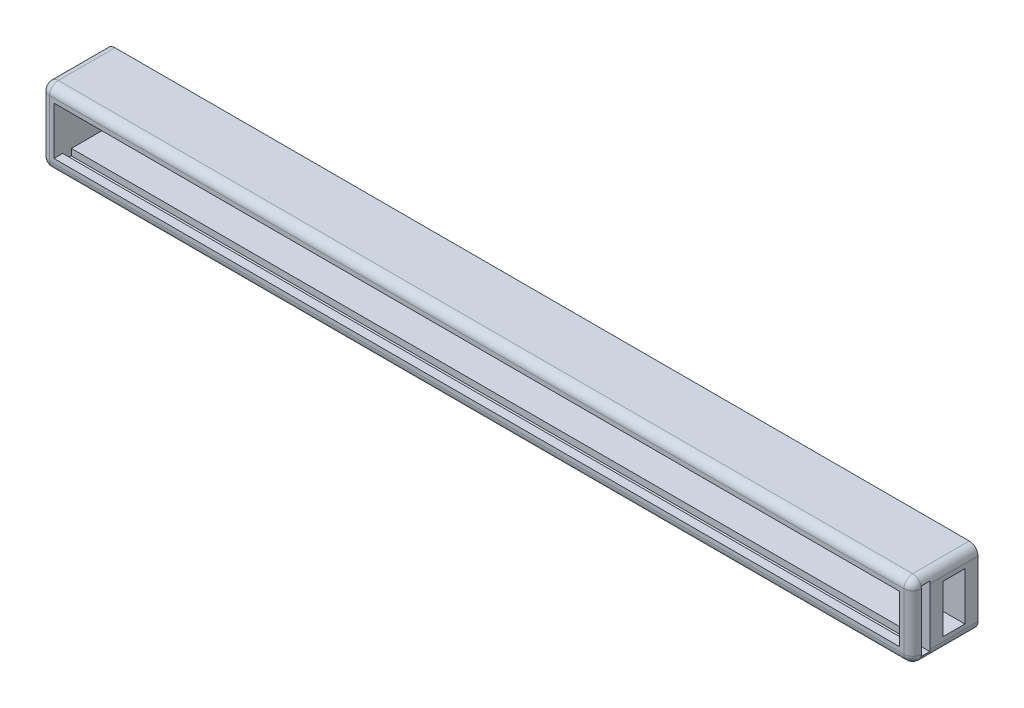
ISO-10303-21;
HEADER;
FILE_DESCRIPTION(('STEP AP214'),'2;1');
FILE_NAME('part.step','',(''),(''),'','','');
FILE_SCHEMA(('AUTOMOTIVE_DESIGN { 1 0 10303 214 1 1 1 1 }'));
ENDSEC;
DATA;
#1=APPLICATION_CONTEXT('core data for automotive mechanical design processes');
#2=APPLICATION_PROTOCOL_DEFINITION('international standard','automotive_design',2000,#1);
#3=PRODUCT_CONTEXT('',#1,'mechanical');
#4=PRODUCT('Part','Part','',(#3));
#5=PRODUCT_RELATED_PRODUCT_CATEGORY('part','',(#4));
#6=PRODUCT_DEFINITION_FORMATION('','',#4);
#7=PRODUCT_DEFINITION_CONTEXT('part definition',#1,'design');
#8=PRODUCT_DEFINITION('design','',#6,#7);
#9=PRODUCT_DEFINITION_SHAPE('','',#8);
#10=(LENGTH_UNIT() NAMED_UNIT(*) SI_UNIT(.MILLI.,.METRE.));
#11=(NAMED_UNIT(*) PLANE_ANGLE_UNIT() SI_UNIT($,.RADIAN.));
#12=(NAMED_UNIT(*) SI_UNIT($,.STERADIAN.) SOLID_ANGLE_UNIT());
#13=UNCERTAINTY_MEASURE_WITH_UNIT(LENGTH_MEASURE(1.E-05),#10,'distance_accuracy_value','');
#14=(GEOMETRIC_REPRESENTATION_CONTEXT(3) GLOBAL_UNCERTAINTY_ASSIGNED_CONTEXT((#13)) GLOBAL_UNIT_ASSIGNED_CONTEXT((#10,
#11,#12)) REPRESENTATION_CONTEXT('',''));
#15=CARTESIAN_POINT('',(0.,0.,0.));
#16=DIRECTION('',(0.,0.,1.));
#17=DIRECTION('',(1.,0.,0.));
#18=AXIS2_PLACEMENT_3D('',#15,#16,#17);
#19=CARTESIAN_POINT('',(100.,-8.49999999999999,15.));
#20=DIRECTION('',(-1.,0.,0.));
#21=DIRECTION('',(0.,0.,1.));
#22=AXIS2_PLACEMENT_3D('',#19,#20,#21);
#23=PLANE('',#22);
#24=DIRECTION('',(0.,0.,1.));
#25=VECTOR('',#24,1.);
#26=CARTESIAN_POINT('',(100.,5.50000000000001,3.));
#27=LINE('',#26,#25);
#28=CARTESIAN_POINT('',(100.,5.50000000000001,3.));
#29=VERTEX_POINT('',#28);
#30=CARTESIAN_POINT('',(100.,5.50000000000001,8.));
#31=VERTEX_POINT('',#30);
#32=EDGE_CURVE('E273',#29,#31,#27,.T.);
#33=ORIENTED_EDGE('',*,*,#32,.F.);
#34=DIRECTION('',(0.,1.,0.));
#35=VECTOR('',#34,1.);
#36=CARTESIAN_POINT('',(100.,-5.49999999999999,3.));
#37=LINE('',#36,#35);
#38=CARTESIAN_POINT('',(100.,-5.49999999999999,3.));
#39=VERTEX_POINT('',#38);
#40=EDGE_CURVE('E270',#39,#29,#37,.T.);
#41=ORIENTED_EDGE('',*,*,#40,.F.);
#42=DIRECTION('',(0.,0.,-1.));
#43=VECTOR('',#42,1.);
#44=CARTESIAN_POINT('',(100.,-5.49999999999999,3.));
#45=LINE('',#44,#43);
#46=CARTESIAN_POINT('',(100.,-5.49999999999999,8.));
#47=VERTEX_POINT('',#46);
#48=EDGE_CURVE('E280',#47,#39,#45,.T.);
#49=ORIENTED_EDGE('',*,*,#48,.F.);
#50=DIRECTION('',(0.,-1.,0.));
#51=VECTOR('',#50,1.);
#52=CARTESIAN_POINT('',(100.,-5.49999999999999,8.));
#53=LINE('',#52,#51);
#54=EDGE_CURVE('E277',#31,#47,#53,.T.);
#55=ORIENTED_EDGE('',*,*,#54,.F.);
#56=EDGE_LOOP('',(#33,#41,#49,#55));
#57=FACE_BOUND('',#56,.T.);
#58=DIRECTION('',(0.,1.,0.));
#59=VECTOR('',#58,1.);
#60=CARTESIAN_POINT('',(100.,6.99999999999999,11.));
#61=LINE('',#60,#59);
#62=CARTESIAN_POINT('',(100.,-6.49999999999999,11.));
#63=VERTEX_POINT('',#62);
#64=CARTESIAN_POINT('',(100.,6.50000000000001,11.));
#65=VERTEX_POINT('',#64);
#66=EDGE_CURVE('E236',#63,#65,#61,.T.);
#67=ORIENTED_EDGE('',*,*,#66,.F.);
#68=DIRECTION('',(0.,0.,-1.));
#69=VECTOR('',#68,1.);
#70=CARTESIAN_POINT('',(100.,-6.49999999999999,15.));
#71=LINE('',#70,#69);
#72=CARTESIAN_POINT('',(100.,-6.49999999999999,0.));
#73=VERTEX_POINT('',#72);
#74=EDGE_CURVE('E53',#63,#73,#71,.T.);
#75=ORIENTED_EDGE('',*,*,#74,.T.);
#76=DIRECTION('',(0.,1.,0.));
#77=VECTOR('',#76,1.);
#78=CARTESIAN_POINT('',(100.,-8.49999999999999,0.));
#79=LINE('',#78,#77);
#80=CARTESIAN_POINT('',(100.,6.50000000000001,0.));
#81=VERTEX_POINT('',#80);
#82=EDGE_CURVE('E319',#73,#81,#79,.T.);
#83=ORIENTED_EDGE('',*,*,#82,.T.);
#84=DIRECTION('',(0.,0.,-1.));
#85=VECTOR('',#84,1.);
#86=CARTESIAN_POINT('',(100.,6.50000000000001,15.));
#87=LINE('',#86,#85);
#88=EDGE_CURVE('E400',#81,#65,#87,.F.);
#89=ORIENTED_EDGE('',*,*,#88,.T.);
#90=EDGE_LOOP('',(#67,#75,#83,#89));
#91=FACE_BOUND('',#90,.T.);
#92=ADVANCED_FACE('F45',(#57,#91),#23,.F.);
#93=CARTESIAN_POINT('',(-97.,-5.49999999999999,24.));
#94=DIRECTION('',(0.,1.,0.));
#95=DIRECTION('',(0.,0.,1.));
#96=AXIS2_PLACEMENT_3D('',#93,#94,#95);
#97=PLANE('',#96);
#98=DIRECTION('',(0.,0.,-1.));
#99=VECTOR('',#98,1.);
#100=CARTESIAN_POINT('',(-97.,-5.49999999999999,24.));
#101=LINE('',#100,#99);
#102=CARTESIAN_POINT('',(-97.,-5.49999999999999,11.));
#103=VERTEX_POINT('',#102);
#104=CARTESIAN_POINT('',(-97.,-5.49999999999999,3.));
#105=VERTEX_POINT('',#104);
#106=EDGE_CURVE('E310',#103,#105,#101,.T.);
#107=ORIENTED_EDGE('',*,*,#106,.F.);
#108=DIRECTION('',(1.,0.,0.));
#109=VECTOR('',#108,1.);
#110=CARTESIAN_POINT('',(-97.,-5.49999999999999,11.));
#111=LINE('',#110,#109);
#112=CARTESIAN_POINT('',(97.,-5.49999999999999,11.));
#113=VERTEX_POINT('',#112);
#114=EDGE_CURVE('E218',#103,#113,#111,.T.);
#115=ORIENTED_EDGE('',*,*,#114,.T.);
#116=DIRECTION('',(0.,0.,-1.));
#117=VECTOR('',#116,1.);
#118=CARTESIAN_POINT('',(97.,-5.49999999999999,24.));
#119=LINE('',#118,#117);
#120=CARTESIAN_POINT('',(97.,-5.49999999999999,8.));
#121=VERTEX_POINT('',#120);
#122=EDGE_CURVE('E306',#113,#121,#119,.T.);
#123=ORIENTED_EDGE('',*,*,#122,.T.);
#124=DIRECTION('',(1.,0.,0.));
#125=VECTOR('',#124,1.);
#126=CARTESIAN_POINT('',(88.,-5.49999999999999,8.));
#127=LINE('',#126,#125);
#128=EDGE_CURVE('E284',#121,#47,#127,.T.);
#129=ORIENTED_EDGE('',*,*,#128,.T.);
#130=ORIENTED_EDGE('',*,*,#48,.T.);
#131=DIRECTION('',(1.,0.,0.));
#132=VECTOR('',#131,1.);
#133=CARTESIAN_POINT('',(-97.,-5.49999999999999,3.));
#134=LINE('',#133,#132);
#135=EDGE_CURVE('E293',#105,#39,#134,.T.);
#136=ORIENTED_EDGE('',*,*,#135,.F.);
#137=EDGE_LOOP('',(#107,#115,#123,#129,#130,#136));
#138=FACE_BOUND('',#137,.T.);
#139=ADVANCED_FACE('F492',(#138),#97,.T.);
#140=CARTESIAN_POINT('',(97.,5.49999999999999,24.));
#141=DIRECTION('',(-1.,0.,0.));
#142=DIRECTION('',(0.,0.,1.));
#143=AXIS2_PLACEMENT_3D('',#140,#141,#142);
#144=PLANE('',#143);
#145=ORIENTED_EDGE('',*,*,#122,.F.);
#146=DIRECTION('',(0.,1.,0.));
#147=VECTOR('',#146,1.);
#148=CARTESIAN_POINT('',(97.,5.49999999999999,11.));
#149=LINE('',#148,#147);
#150=CARTESIAN_POINT('',(97.,5.49999999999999,11.));
#151=VERTEX_POINT('',#150);
#152=EDGE_CURVE('E264',#113,#151,#149,.T.);
#153=ORIENTED_EDGE('',*,*,#152,.T.);
#154=DIRECTION('',(0.,0.,-1.));
#155=VECTOR('',#154,1.);
#156=CARTESIAN_POINT('',(97.,5.49999999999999,24.));
#157=LINE('',#156,#155);
#158=CARTESIAN_POINT('',(97.,5.49999999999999,8.));
#159=VERTEX_POINT('',#158);
#160=EDGE_CURVE('E302',#151,#159,#157,.T.);
#161=ORIENTED_EDGE('',*,*,#160,.T.);
#162=DIRECTION('',(0.,1.,0.));
#163=VECTOR('',#162,1.);
#164=CARTESIAN_POINT('',(97.,5.49999999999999,8.));
#165=LINE('',#164,#163);
#166=EDGE_CURVE('E286',#121,#159,#165,.T.);
#167=ORIENTED_EDGE('',*,*,#166,.F.);
#168=EDGE_LOOP('',(#145,#153,#161,#167));
#169=FACE_BOUND('',#168,.T.);
#170=ADVANCED_FACE('F490',(#169),#144,.T.);
#171=CARTESIAN_POINT('',(-97.,5.49999999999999,24.));
#172=DIRECTION('',(0.,-1.,0.));
#173=DIRECTION('',(0.,0.,-1.));
#174=AXIS2_PLACEMENT_3D('',#171,#172,#173);
#175=PLANE('',#174);
#176=ORIENTED_EDGE('',*,*,#160,.F.);
#177=DIRECTION('',(-1.,0.,0.));
#178=VECTOR('',#177,1.);
#179=CARTESIAN_POINT('',(-97.,5.49999999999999,11.));
#180=LINE('',#179,#178);
#181=CARTESIAN_POINT('',(-97.,5.49999999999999,11.));
#182=VERTEX_POINT('',#181);
#183=EDGE_CURVE('E262',#151,#182,#180,.T.);
#184=ORIENTED_EDGE('',*,*,#183,.T.);
#185=DIRECTION('',(0.,0.,-1.));
#186=VECTOR('',#185,1.);
#187=CARTESIAN_POINT('',(-97.,5.49999999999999,24.));
#188=LINE('',#187,#186);
#189=CARTESIAN_POINT('',(-97.,5.49999999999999,3.));
#190=VERTEX_POINT('',#189);
#191=EDGE_CURVE('E298',#182,#190,#188,.T.);
#192=ORIENTED_EDGE('',*,*,#191,.T.);
#193=DIRECTION('',(-1.,0.,0.));
#194=VECTOR('',#193,1.);
#195=CARTESIAN_POINT('',(-97.,5.49999999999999,3.));
#196=LINE('',#195,#194);
#197=EDGE_CURVE('E295',#29,#190,#196,.T.);
#198=ORIENTED_EDGE('',*,*,#197,.F.);
#199=ORIENTED_EDGE('',*,*,#32,.T.);
#200=DIRECTION('',(1.,0.,0.));
#201=VECTOR('',#200,1.);
#202=CARTESIAN_POINT('',(88.,5.50000000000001,8.));
#203=LINE('',#202,#201);
#204=EDGE_CURVE('E283',#159,#31,#203,.T.);
#205=ORIENTED_EDGE('',*,*,#204,.F.);
#206=EDGE_LOOP('',(#176,#184,#192,#198,#199,#205));
#207=FACE_BOUND('',#206,.T.);
#208=ADVANCED_FACE('F474',(#207),#175,.T.);
#209=CARTESIAN_POINT('',(98.,-6.49999999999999,15.));
#210=DIRECTION('',(0.,0.,-1.));
#211=DIRECTION('',(-1.,0.,0.));
#212=AXIS2_PLACEMENT_3D('',#209,#210,#211);
#213=CYLINDRICAL_SURFACE('',#212,2.);
#214=CARTESIAN_POINT('',(98.,-6.49999999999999,11.));
#215=DIRECTION('',(0.,0.,1.));
#216=DIRECTION('',(1.,0.,0.));
#217=AXIS2_PLACEMENT_3D('',#214,#215,#216);
#218=CIRCLE('',#217,2.);
#219=CARTESIAN_POINT('',(99.9364916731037,-6.99999999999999,11.));
#220=VERTEX_POINT('',#219);
#221=EDGE_CURVE('E260',#63,#220,#218,.F.);
#222=ORIENTED_EDGE('',*,*,#221,.T.);
#223=DIRECTION('',(0.,0.,-1.));
#224=VECTOR('',#223,1.);
#225=CARTESIAN_POINT('',(99.9364916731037,-6.99999999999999,15.));
#226=LINE('',#225,#224);
#227=CARTESIAN_POINT('',(99.9364916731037,-6.99999999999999,13.));
#228=VERTEX_POINT('',#227);
#229=EDGE_CURVE('E235',#220,#228,#226,.F.);
#230=ORIENTED_EDGE('',*,*,#229,.T.);
#231=CARTESIAN_POINT('',(98.,-6.49999999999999,13.));
#232=DIRECTION('',(0.,0.,1.));
#233=DIRECTION('',(1.,0.,0.));
#234=AXIS2_PLACEMENT_3D('',#231,#232,#233);
#235=CIRCLE('',#234,2.);
#236=CARTESIAN_POINT('',(98.,-8.49999999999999,13.));
#237=VERTEX_POINT('',#236);
#238=EDGE_CURVE('E409',#237,#228,#235,.T.);
#239=ORIENTED_EDGE('',*,*,#238,.F.);
#240=DIRECTION('',(0.,0.,-1.));
#241=VECTOR('',#240,1.);
#242=CARTESIAN_POINT('',(98.,-8.49999999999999,15.));
#243=LINE('',#242,#241);
#244=CARTESIAN_POINT('',(98.,-8.49999999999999,0.));
#245=VERTEX_POINT('',#244);
#246=EDGE_CURVE('E380',#245,#237,#243,.F.);
#247=ORIENTED_EDGE('',*,*,#246,.F.);
#248=CARTESIAN_POINT('',(98.,-6.49999999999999,0.));
#249=DIRECTION('',(0.,0.,1.));
#250=DIRECTION('',(1.,0.,0.));
#251=AXIS2_PLACEMENT_3D('',#248,#249,#250);
#252=CIRCLE('',#251,2.);
#253=EDGE_CURVE('E386',#73,#245,#252,.F.);
#254=ORIENTED_EDGE('',*,*,#253,.F.);
#255=ORIENTED_EDGE('',*,*,#74,.F.);
#256=EDGE_LOOP('',(#222,#230,#239,#247,#254,#255));
#257=FACE_BOUND('',#256,.T.);
#258=ADVANCED_FACE('F459',(#257),#213,.T.);
#259=CARTESIAN_POINT('',(98.,6.50000000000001,15.));
#260=DIRECTION('',(0.,0.,-1.));
#261=DIRECTION('',(-1.,0.,0.));
#262=AXIS2_PLACEMENT_3D('',#259,#260,#261);
#263=CYLINDRICAL_SURFACE('',#262,2.);
#264=CARTESIAN_POINT('',(98.,6.50000000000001,13.));
#265=DIRECTION('',(0.,0.,1.));
#266=DIRECTION('',(1.,0.,0.));
#267=AXIS2_PLACEMENT_3D('',#264,#265,#266);
#268=CIRCLE('',#267,2.);
#269=CARTESIAN_POINT('',(99.9364916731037,6.99999999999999,13.));
#270=VERTEX_POINT('',#269);
#271=CARTESIAN_POINT('',(98.,8.50000000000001,13.));
#272=VERTEX_POINT('',#271);
#273=EDGE_CURVE('E269',#270,#272,#268,.T.);
#274=ORIENTED_EDGE('',*,*,#273,.F.);
#275=DIRECTION('',(0.,0.,-1.));
#276=VECTOR('',#275,1.);
#277=CARTESIAN_POINT('',(99.9364916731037,6.99999999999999,15.));
#278=LINE('',#277,#276);
#279=CARTESIAN_POINT('',(99.9364916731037,6.99999999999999,11.));
#280=VERTEX_POINT('',#279);
#281=EDGE_CURVE('E257',#270,#280,#278,.T.);
#282=ORIENTED_EDGE('',*,*,#281,.T.);
#283=CARTESIAN_POINT('',(98.,6.50000000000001,11.));
#284=DIRECTION('',(0.,0.,1.));
#285=DIRECTION('',(1.,0.,0.));
#286=AXIS2_PLACEMENT_3D('',#283,#284,#285);
#287=CIRCLE('',#286,2.);
#288=EDGE_CURVE('E11',#280,#65,#287,.F.);
#289=ORIENTED_EDGE('',*,*,#288,.T.);
#290=ORIENTED_EDGE('',*,*,#88,.F.);
#291=CARTESIAN_POINT('',(98.,6.50000000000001,0.));
#292=DIRECTION('',(0.,0.,1.));
#293=DIRECTION('',(1.,0.,0.));
#294=AXIS2_PLACEMENT_3D('',#291,#292,#293);
#295=CIRCLE('',#294,2.);
#296=CARTESIAN_POINT('',(98.,8.50000000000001,0.));
#297=VERTEX_POINT('',#296);
#298=EDGE_CURVE('E384',#297,#81,#295,.F.);
#299=ORIENTED_EDGE('',*,*,#298,.F.);
#300=DIRECTION('',(0.,0.,-1.));
#301=VECTOR('',#300,1.);
#302=CARTESIAN_POINT('',(98.,8.50000000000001,15.));
#303=LINE('',#302,#301);
#304=EDGE_CURVE('E396',#272,#297,#303,.T.);
#305=ORIENTED_EDGE('',*,*,#304,.F.);
#306=EDGE_LOOP('',(#274,#282,#289,#290,#299,#305));
#307=FACE_BOUND('',#306,.T.);
#308=ADVANCED_FACE('F47',(#307),#263,.T.);
#309=CARTESIAN_POINT('',(0.,0.,15.));
#310=DIRECTION('',(0.,0.,1.));
#311=DIRECTION('',(1.,0.,0.));
#312=AXIS2_PLACEMENT_3D('',#309,#310,#311);
#313=PLANE('',#312);
#314=DIRECTION('',(0.,1.,0.));
#315=VECTOR('',#314,1.);
#316=CARTESIAN_POINT('',(98.,8.50000000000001,15.));
#317=LINE('',#316,#315);
#318=CARTESIAN_POINT('',(98.,-6.49999999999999,15.));
#319=VERTEX_POINT('',#318);
#320=CARTESIAN_POINT('',(98.,6.50000000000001,15.));
#321=VERTEX_POINT('',#320);
#322=EDGE_CURVE('E331',#319,#321,#317,.T.);
#323=ORIENTED_EDGE('',*,*,#322,.T.);
#324=DIRECTION('',(-1.,0.,0.));
#325=VECTOR('',#324,1.);
#326=CARTESIAN_POINT('',(-100.,6.49999999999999,15.));
#327=LINE('',#326,#325);
#328=CARTESIAN_POINT('',(-98.,6.49999999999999,15.));
#329=VERTEX_POINT('',#328);
#330=EDGE_CURVE('E334',#321,#329,#327,.T.);
#331=ORIENTED_EDGE('',*,*,#330,.T.);
#332=DIRECTION('',(0.,-1.,0.));
#333=VECTOR('',#332,1.);
#334=CARTESIAN_POINT('',(-98.,-8.50000000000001,15.));
#335=LINE('',#334,#333);
#336=CARTESIAN_POINT('',(-98.,-6.50000000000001,15.));
#337=VERTEX_POINT('',#336);
#338=EDGE_CURVE('E325',#329,#337,#335,.T.);
#339=ORIENTED_EDGE('',*,*,#338,.T.);
#340=DIRECTION('',(1.,0.,0.));
#341=VECTOR('',#340,1.);
#342=CARTESIAN_POINT('',(100.,-6.49999999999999,15.));
#343=LINE('',#342,#341);
#344=EDGE_CURVE('E328',#337,#319,#343,.T.);
#345=ORIENTED_EDGE('',*,*,#344,.T.);
#346=EDGE_LOOP('',(#323,#331,#339,#345));
#347=FACE_BOUND('',#346,.T.);
#348=DIRECTION('',(-1.,0.,0.));
#349=VECTOR('',#348,1.);
#350=CARTESIAN_POINT('',(0.,-5.49999999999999,15.));
#351=LINE('',#350,#349);
#352=CARTESIAN_POINT('',(97.,-5.49999999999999,15.));
#353=VERTEX_POINT('',#352);
#354=CARTESIAN_POINT('',(-97.,-5.49999999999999,15.));
#355=VERTEX_POINT('',#354);
#356=EDGE_CURVE('E354',#353,#355,#351,.T.);
#357=ORIENTED_EDGE('',*,*,#356,.T.);
#358=DIRECTION('',(0.,1.,0.));
#359=VECTOR('',#358,1.);
#360=CARTESIAN_POINT('',(-97.,0.,15.));
#361=LINE('',#360,#359);
#362=CARTESIAN_POINT('',(-97.,5.49999999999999,15.));
#363=VERTEX_POINT('',#362);
#364=EDGE_CURVE('E357',#355,#363,#361,.T.);
#365=ORIENTED_EDGE('',*,*,#364,.T.);
#366=DIRECTION('',(1.,0.,0.));
#367=VECTOR('',#366,1.);
#368=CARTESIAN_POINT('',(0.,5.49999999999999,15.));
#369=LINE('',#368,#367);
#370=CARTESIAN_POINT('',(97.,5.49999999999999,15.));
#371=VERTEX_POINT('',#370);
#372=EDGE_CURVE('E348',#363,#371,#369,.T.);
#373=ORIENTED_EDGE('',*,*,#372,.T.);
#374=DIRECTION('',(0.,-1.,0.));
#375=VECTOR('',#374,1.);
#376=CARTESIAN_POINT('',(97.,0.,15.));
#377=LINE('',#376,#375);
#378=EDGE_CURVE('E351',#371,#353,#377,.T.);
#379=ORIENTED_EDGE('',*,*,#378,.T.);
#380=EDGE_LOOP('',(#357,#365,#373,#379));
#381=FACE_BOUND('',#380,.T.);
#382=ADVANCED_FACE('F445',(#347,#381),#313,.T.);
#383=CARTESIAN_POINT('',(-100.,-8.50000000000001,15.));
#384=DIRECTION('',(1.,0.,0.));
#385=DIRECTION('',(0.,1.,0.));
#386=AXIS2_PLACEMENT_3D('',#383,#384,#385);
#387=PLANE('',#386);
#388=DIRECTION('',(0.,-1.,0.));
#389=VECTOR('',#388,1.);
#390=CARTESIAN_POINT('',(-100.,-8.50000000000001,0.));
#391=LINE('',#390,#389);
#392=CARTESIAN_POINT('',(-100.,6.49999999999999,0.));
#393=VERTEX_POINT('',#392);
#394=CARTESIAN_POINT('',(-100.,-6.50000000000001,0.));
#395=VERTEX_POINT('',#394);
#396=EDGE_CURVE('E313',#393,#395,#391,.T.);
#397=ORIENTED_EDGE('',*,*,#396,.T.);
#398=DIRECTION('',(0.,0.,-1.));
#399=VECTOR('',#398,1.);
#400=CARTESIAN_POINT('',(-100.,-6.50000000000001,15.));
#401=LINE('',#400,#399);
#402=CARTESIAN_POINT('',(-100.,-6.50000000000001,13.));
#403=VERTEX_POINT('',#402);
#404=EDGE_CURVE('E394',#395,#403,#401,.F.);
#405=ORIENTED_EDGE('',*,*,#404,.T.);
#406=DIRECTION('',(0.,-1.,0.));
#407=VECTOR('',#406,1.);
#408=CARTESIAN_POINT('',(-100.,8.49999999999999,13.));
#409=LINE('',#408,#407);
#410=CARTESIAN_POINT('',(-100.,6.49999999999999,13.));
#411=VERTEX_POINT('',#410);
#412=EDGE_CURVE('E345',#403,#411,#409,.F.);
#413=ORIENTED_EDGE('',*,*,#412,.T.);
#414=DIRECTION('',(0.,0.,-1.));
#415=VECTOR('',#414,1.);
#416=CARTESIAN_POINT('',(-100.,6.49999999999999,15.));
#417=LINE('',#416,#415);
#418=EDGE_CURVE('E392',#411,#393,#417,.T.);
#419=ORIENTED_EDGE('',*,*,#418,.T.);
#420=EDGE_LOOP('',(#397,#405,#413,#419));
#421=FACE_BOUND('',#420,.T.);
#422=ADVANCED_FACE('F569',(#421),#387,.F.);
#423=CARTESIAN_POINT('',(100.,-8.49999999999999,15.));
#424=DIRECTION('',(0.,1.,0.));
#425=DIRECTION('',(-1.,0.,0.));
#426=AXIS2_PLACEMENT_3D('',#423,#424,#425);
#427=PLANE('',#426);
#428=DIRECTION('',(1.,0.,0.));
#429=VECTOR('',#428,1.);
#430=CARTESIAN_POINT('',(-100.,-8.50000000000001,13.));
#431=LINE('',#430,#429);
#432=CARTESIAN_POINT('',(-98.,-8.50000000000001,13.));
#433=VERTEX_POINT('',#432);
#434=EDGE_CURVE('E342',#237,#433,#431,.F.);
#435=ORIENTED_EDGE('',*,*,#434,.T.);
#436=DIRECTION('',(0.,0.,-1.));
#437=VECTOR('',#436,1.);
#438=CARTESIAN_POINT('',(-98.,-8.50000000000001,15.));
#439=LINE('',#438,#437);
#440=CARTESIAN_POINT('',(-98.,-8.50000000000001,0.));
#441=VERTEX_POINT('',#440);
#442=EDGE_CURVE('E382',#433,#441,#439,.T.);
#443=ORIENTED_EDGE('',*,*,#442,.T.);
#444=DIRECTION('',(1.,0.,0.));
#445=VECTOR('',#444,1.);
#446=CARTESIAN_POINT('',(100.,-8.49999999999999,0.));
#447=LINE('',#446,#445);
#448=EDGE_CURVE('E316',#441,#245,#447,.T.);
#449=ORIENTED_EDGE('',*,*,#448,.T.);
#450=ORIENTED_EDGE('',*,*,#246,.T.);
#451=EDGE_LOOP('',(#435,#443,#449,#450));
#452=FACE_BOUND('',#451,.T.);
#453=ADVANCED_FACE('F572',(#452),#427,.F.);
#454=CARTESIAN_POINT('',(100.,8.50000000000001,15.));
#455=DIRECTION('',(0.,-1.,0.));
#456=DIRECTION('',(1.,0.,0.));
#457=AXIS2_PLACEMENT_3D('',#454,#455,#456);
#458=PLANE('',#457);
#459=DIRECTION('',(-1.,0.,0.));
#460=VECTOR('',#459,1.);
#461=CARTESIAN_POINT('',(100.,8.50000000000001,0.));
#462=LINE('',#461,#460);
#463=CARTESIAN_POINT('',(-98.,8.49999999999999,0.));
#464=VERTEX_POINT('',#463);
#465=EDGE_CURVE('E322',#297,#464,#462,.T.);
#466=ORIENTED_EDGE('',*,*,#465,.T.);
#467=DIRECTION('',(0.,0.,-1.));
#468=VECTOR('',#467,1.);
#469=CARTESIAN_POINT('',(-98.,8.49999999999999,15.));
#470=LINE('',#469,#468);
#471=CARTESIAN_POINT('',(-98.,8.49999999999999,13.));
#472=VERTEX_POINT('',#471);
#473=EDGE_CURVE('E398',#464,#472,#470,.F.);
#474=ORIENTED_EDGE('',*,*,#473,.T.);
#475=DIRECTION('',(-1.,0.,0.));
#476=VECTOR('',#475,1.);
#477=CARTESIAN_POINT('',(100.,8.50000000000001,13.));
#478=LINE('',#477,#476);
#479=EDGE_CURVE('E337',#472,#272,#478,.F.);
#480=ORIENTED_EDGE('',*,*,#479,.T.);
#481=ORIENTED_EDGE('',*,*,#304,.T.);
#482=EDGE_LOOP('',(#466,#474,#480,#481));
#483=FACE_BOUND('',#482,.T.);
#484=ADVANCED_FACE('F429',(#483),#458,.F.);
#485=CARTESIAN_POINT('',(0.,0.,0.));
#486=DIRECTION('',(0.,0.,1.));
#487=DIRECTION('',(1.,0.,0.));
#488=AXIS2_PLACEMENT_3D('',#485,#486,#487);
#489=PLANE('',#488);
#490=ORIENTED_EDGE('',*,*,#448,.F.);
#491=CARTESIAN_POINT('',(-98.,-6.50000000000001,0.));
#492=DIRECTION('',(0.,0.,1.));
#493=DIRECTION('',(1.,0.,0.));
#494=AXIS2_PLACEMENT_3D('',#491,#492,#493);
#495=CIRCLE('',#494,2.);
#496=EDGE_CURVE('E390',#441,#395,#495,.F.);
#497=ORIENTED_EDGE('',*,*,#496,.T.);
#498=ORIENTED_EDGE('',*,*,#396,.F.);
#499=CARTESIAN_POINT('',(-98.,6.49999999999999,0.));
#500=DIRECTION('',(0.,0.,1.));
#501=DIRECTION('',(1.,0.,0.));
#502=AXIS2_PLACEMENT_3D('',#499,#500,#501);
#503=CIRCLE('',#502,2.);
#504=EDGE_CURVE('E388',#393,#464,#503,.F.);
#505=ORIENTED_EDGE('',*,*,#504,.T.);
#506=ORIENTED_EDGE('',*,*,#465,.F.);
#507=ORIENTED_EDGE('',*,*,#298,.T.);
#508=ORIENTED_EDGE('',*,*,#82,.F.);
#509=ORIENTED_EDGE('',*,*,#253,.T.);
#510=EDGE_LOOP('',(#490,#497,#498,#505,#506,#507,#508,#509));
#511=FACE_BOUND('',#510,.T.);
#512=ADVANCED_FACE('F561',(#511),#489,.F.);
#513=CARTESIAN_POINT('',(0.,-6.5,13.));
#514=DIRECTION('',(-1.,0.,0.));
#515=DIRECTION('',(0.,-1.,0.));
#516=AXIS2_PLACEMENT_3D('',#513,#514,#515);
#517=CYLINDRICAL_SURFACE('',#516,2.);
#518=ORIENTED_EDGE('',*,*,#344,.F.);
#519=CARTESIAN_POINT('',(-98.,-6.50000000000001,13.));
#520=DIRECTION('',(-1.,0.,0.));
#521=DIRECTION('',(0.,-1.,0.));
#522=AXIS2_PLACEMENT_3D('',#519,#520,#521);
#523=CIRCLE('',#522,2.);
#524=EDGE_CURVE('E367',#337,#433,#523,.F.);
#525=ORIENTED_EDGE('',*,*,#524,.T.);
#526=ORIENTED_EDGE('',*,*,#434,.F.);
#527=CARTESIAN_POINT('',(98.,-6.49999999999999,13.));
#528=DIRECTION('',(-1.,0.,0.));
#529=DIRECTION('',(0.,-1.,0.));
#530=AXIS2_PLACEMENT_3D('',#527,#528,#529);
#531=CIRCLE('',#530,2.);
#532=EDGE_CURVE('E365',#237,#319,#531,.T.);
#533=ORIENTED_EDGE('',*,*,#532,.T.);
#534=EDGE_LOOP('',(#518,#525,#526,#533));
#535=FACE_BOUND('',#534,.T.);
#536=ADVANCED_FACE('F558',(#535),#517,.T.);
#537=CARTESIAN_POINT('',(98.,0.,13.));
#538=DIRECTION('',(0.,-1.,0.));
#539=DIRECTION('',(0.,0.,-1.));
#540=AXIS2_PLACEMENT_3D('',#537,#538,#539);
#541=CYLINDRICAL_SURFACE('',#540,2.);
#542=ORIENTED_EDGE('',*,*,#322,.F.);
#543=CARTESIAN_POINT('',(98.,-6.49999999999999,13.));
#544=DIRECTION('',(0.,-1.,0.));
#545=DIRECTION('',(0.,0.,-1.));
#546=AXIS2_PLACEMENT_3D('',#543,#544,#545);
#547=CIRCLE('',#546,2.);
#548=CARTESIAN_POINT('',(100.,-6.49999999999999,13.));
#549=VERTEX_POINT('',#548);
#550=EDGE_CURVE('E377',#319,#549,#547,.F.);
#551=ORIENTED_EDGE('',*,*,#550,.T.);
#552=DIRECTION('',(0.,1.,0.));
#553=VECTOR('',#552,1.);
#554=CARTESIAN_POINT('',(100.,-8.49999999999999,13.));
#555=LINE('',#554,#553);
#556=CARTESIAN_POINT('',(100.,6.50000000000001,13.));
#557=VERTEX_POINT('',#556);
#558=EDGE_CURVE('E340',#557,#549,#555,.F.);
#559=ORIENTED_EDGE('',*,*,#558,.F.);
#560=CARTESIAN_POINT('',(98.,6.50000000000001,13.));
#561=DIRECTION('',(0.,-1.,0.));
#562=DIRECTION('',(0.,0.,-1.));
#563=AXIS2_PLACEMENT_3D('',#560,#561,#562);
#564=CIRCLE('',#563,2.);
#565=EDGE_CURVE('E375',#557,#321,#564,.T.);
#566=ORIENTED_EDGE('',*,*,#565,.T.);
#567=EDGE_LOOP('',(#542,#551,#559,#566));
#568=FACE_BOUND('',#567,.T.);
#569=ADVANCED_FACE('F450',(#568),#541,.T.);
#570=CARTESIAN_POINT('',(-98.,0.,13.));
#571=DIRECTION('',(0.,1.,0.));
#572=DIRECTION('',(-1.,0.,0.));
#573=AXIS2_PLACEMENT_3D('',#570,#571,#572);
#574=CYLINDRICAL_SURFACE('',#573,2.);
#575=ORIENTED_EDGE('',*,*,#412,.F.);
#576=CARTESIAN_POINT('',(-98.,-6.50000000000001,13.));
#577=DIRECTION('',(0.,1.,0.));
#578=DIRECTION('',(-1.,0.,0.));
#579=AXIS2_PLACEMENT_3D('',#576,#577,#578);
#580=CIRCLE('',#579,2.);
#581=EDGE_CURVE('E362',#403,#337,#580,.T.);
#582=ORIENTED_EDGE('',*,*,#581,.T.);
#583=ORIENTED_EDGE('',*,*,#338,.F.);
#584=CARTESIAN_POINT('',(-98.,6.49999999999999,13.));
#585=DIRECTION('',(0.,1.,0.));
#586=DIRECTION('',(-1.,0.,0.));
#587=AXIS2_PLACEMENT_3D('',#584,#585,#586);
#588=CIRCLE('',#587,2.);
#589=EDGE_CURVE('E360',#329,#411,#588,.F.);
#590=ORIENTED_EDGE('',*,*,#589,.T.);
#591=EDGE_LOOP('',(#575,#582,#583,#590));
#592=FACE_BOUND('',#591,.T.);
#593=ADVANCED_FACE('F441',(#592),#574,.T.);
#594=CARTESIAN_POINT('',(0.,6.5,13.));
#595=DIRECTION('',(1.,0.,0.));
#596=DIRECTION('',(0.,1.,0.));
#597=AXIS2_PLACEMENT_3D('',#594,#595,#596);
#598=CYLINDRICAL_SURFACE('',#597,2.);
#599=ORIENTED_EDGE('',*,*,#479,.F.);
#600=CARTESIAN_POINT('',(-98.,6.49999999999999,13.));
#601=DIRECTION('',(1.,0.,0.));
#602=DIRECTION('',(0.,1.,0.));
#603=AXIS2_PLACEMENT_3D('',#600,#601,#602);
#604=CIRCLE('',#603,2.);
#605=EDGE_CURVE('E372',#472,#329,#604,.T.);
#606=ORIENTED_EDGE('',*,*,#605,.T.);
#607=ORIENTED_EDGE('',*,*,#330,.F.);
#608=CARTESIAN_POINT('',(98.,6.50000000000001,13.));
#609=DIRECTION('',(1.,0.,0.));
#610=DIRECTION('',(0.,1.,0.));
#611=AXIS2_PLACEMENT_3D('',#608,#609,#610);
#612=CIRCLE('',#611,2.);
#613=EDGE_CURVE('E369',#321,#272,#612,.F.);
#614=ORIENTED_EDGE('',*,*,#613,.T.);
#615=EDGE_LOOP('',(#599,#606,#607,#614));
#616=FACE_BOUND('',#615,.T.);
#617=ADVANCED_FACE('F427',(#616),#598,.T.);
#618=CARTESIAN_POINT('',(-97.,5.49999999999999,24.));
#619=DIRECTION('',(1.,0.,0.));
#620=DIRECTION('',(0.,0.,-1.));
#621=AXIS2_PLACEMENT_3D('',#618,#619,#620);
#622=PLANE('',#621);
#623=CARTESIAN_POINT('',(-97.,-5.49999999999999,13.));
#624=VERTEX_POINT('',#623);
#625=EDGE_CURVE('E311',#355,#624,#101,.T.);
#626=ORIENTED_EDGE('',*,*,#625,.T.);
#627=DIRECTION('',(0.,-1.,0.));
#628=VECTOR('',#627,1.);
#629=CARTESIAN_POINT('',(-97.,6.99999999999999,13.));
#630=LINE('',#629,#628);
#631=CARTESIAN_POINT('',(-97.,-6.99999999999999,13.));
#632=VERTEX_POINT('',#631);
#633=EDGE_CURVE('E226',#624,#632,#630,.T.);
#634=ORIENTED_EDGE('',*,*,#633,.T.);
#635=DIRECTION('',(0.,0.,-1.));
#636=VECTOR('',#635,1.);
#637=CARTESIAN_POINT('',(-97.,-6.99999999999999,13.));
#638=LINE('',#637,#636);
#639=CARTESIAN_POINT('',(-97.,-6.99999999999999,11.));
#640=VERTEX_POINT('',#639);
#641=EDGE_CURVE('E223',#632,#640,#638,.T.);
#642=ORIENTED_EDGE('',*,*,#641,.T.);
#643=DIRECTION('',(0.,-1.,0.));
#644=VECTOR('',#643,1.);
#645=CARTESIAN_POINT('',(-97.,6.99999999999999,11.));
#646=LINE('',#645,#644);
#647=EDGE_CURVE('E211',#103,#640,#646,.T.);
#648=ORIENTED_EDGE('',*,*,#647,.F.);
#649=ORIENTED_EDGE('',*,*,#106,.T.);
#650=DIRECTION('',(0.,-1.,0.));
#651=VECTOR('',#650,1.);
#652=CARTESIAN_POINT('',(-97.,5.49999999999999,3.));
#653=LINE('',#652,#651);
#654=EDGE_CURVE('E290',#190,#105,#653,.T.);
#655=ORIENTED_EDGE('',*,*,#654,.F.);
#656=ORIENTED_EDGE('',*,*,#191,.F.);
#657=CARTESIAN_POINT('',(-97.,6.99999999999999,11.));
#658=VERTEX_POINT('',#657);
#659=EDGE_CURVE('E60',#658,#182,#646,.T.);
#660=ORIENTED_EDGE('',*,*,#659,.F.);
#661=DIRECTION('',(0.,0.,-1.));
#662=VECTOR('',#661,1.);
#663=CARTESIAN_POINT('',(-97.,6.99999999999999,13.));
#664=LINE('',#663,#662);
#665=CARTESIAN_POINT('',(-97.,6.99999999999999,13.));
#666=VERTEX_POINT('',#665);
#667=EDGE_CURVE('E231',#666,#658,#664,.T.);
#668=ORIENTED_EDGE('',*,*,#667,.F.);
#669=CARTESIAN_POINT('',(-97.,5.49999999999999,13.));
#670=VERTEX_POINT('',#669);
#671=EDGE_CURVE('E242',#666,#670,#630,.T.);
#672=ORIENTED_EDGE('',*,*,#671,.T.);
#673=EDGE_CURVE('E299',#363,#670,#188,.T.);
#674=ORIENTED_EDGE('',*,*,#673,.F.);
#675=ORIENTED_EDGE('',*,*,#364,.F.);
#676=EDGE_LOOP('',(#626,#634,#642,#648,#649,#655,#656,#660,#668,#672,#674,#675));
#677=FACE_BOUND('',#676,.T.);
#678=ADVANCED_FACE('F225',(#677),#622,.T.);
#679=DIRECTION('',(1.,0.,0.));
#680=VECTOR('',#679,1.);
#681=CARTESIAN_POINT('',(-97.,-5.49999999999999,13.));
#682=LINE('',#681,#680);
#683=CARTESIAN_POINT('',(97.,-5.49999999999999,13.));
#684=VERTEX_POINT('',#683);
#685=EDGE_CURVE('E255',#624,#684,#682,.T.);
#686=ORIENTED_EDGE('',*,*,#685,.F.);
#687=ORIENTED_EDGE('',*,*,#625,.F.);
#688=ORIENTED_EDGE('',*,*,#356,.F.);
#689=EDGE_CURVE('E307',#353,#684,#119,.T.);
#690=ORIENTED_EDGE('',*,*,#689,.T.);
#691=EDGE_LOOP('',(#686,#687,#688,#690));
#692=FACE_BOUND('',#691,.T.);
#693=ADVANCED_FACE('F495',(#692),#97,.T.);
#694=DIRECTION('',(0.,1.,0.));
#695=VECTOR('',#694,1.);
#696=CARTESIAN_POINT('',(97.,5.49999999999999,13.));
#697=LINE('',#696,#695);
#698=CARTESIAN_POINT('',(97.,5.49999999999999,13.));
#699=VERTEX_POINT('',#698);
#700=EDGE_CURVE('E253',#684,#699,#697,.T.);
#701=ORIENTED_EDGE('',*,*,#700,.F.);
#702=ORIENTED_EDGE('',*,*,#689,.F.);
#703=ORIENTED_EDGE('',*,*,#378,.F.);
#704=EDGE_CURVE('E303',#371,#699,#157,.T.);
#705=ORIENTED_EDGE('',*,*,#704,.T.);
#706=EDGE_LOOP('',(#701,#702,#703,#705));
#707=FACE_BOUND('',#706,.T.);
#708=ADVANCED_FACE('F501',(#707),#144,.T.);
#709=DIRECTION('',(-1.,0.,0.));
#710=VECTOR('',#709,1.);
#711=CARTESIAN_POINT('',(-97.,5.49999999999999,13.));
#712=LINE('',#711,#710);
#713=EDGE_CURVE('E251',#699,#670,#712,.T.);
#714=ORIENTED_EDGE('',*,*,#713,.F.);
#715=ORIENTED_EDGE('',*,*,#704,.F.);
#716=ORIENTED_EDGE('',*,*,#372,.F.);
#717=ORIENTED_EDGE('',*,*,#673,.T.);
#718=EDGE_LOOP('',(#714,#715,#716,#717));
#719=FACE_BOUND('',#718,.T.);
#720=ADVANCED_FACE('F510',(#719),#175,.T.);
#721=CARTESIAN_POINT('',(0.,0.,3.));
#722=DIRECTION('',(0.,0.,1.));
#723=DIRECTION('',(1.,0.,0.));
#724=AXIS2_PLACEMENT_3D('',#721,#722,#723);
#725=PLANE('',#724);
#726=ORIENTED_EDGE('',*,*,#197,.T.);
#727=ORIENTED_EDGE('',*,*,#654,.T.);
#728=ORIENTED_EDGE('',*,*,#135,.T.);
#729=ORIENTED_EDGE('',*,*,#40,.T.);
#730=EDGE_LOOP('',(#726,#727,#728,#729));
#731=FACE_BOUND('',#730,.T.);
#732=ADVANCED_FACE('F476',(#731),#725,.T.);
#733=CARTESIAN_POINT('',(88.,-5.49999999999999,8.));
#734=DIRECTION('',(0.,0.,1.));
#735=DIRECTION('',(1.,0.,0.));
#736=AXIS2_PLACEMENT_3D('',#733,#734,#735);
#737=PLANE('',#736);
#738=ORIENTED_EDGE('',*,*,#166,.T.);
#739=ORIENTED_EDGE('',*,*,#204,.T.);
#740=ORIENTED_EDGE('',*,*,#54,.T.);
#741=ORIENTED_EDGE('',*,*,#128,.F.);
#742=EDGE_LOOP('',(#738,#739,#740,#741));
#743=FACE_BOUND('',#742,.T.);
#744=ADVANCED_FACE('F487',(#743),#737,.F.);
#745=CARTESIAN_POINT('',(-98.,-6.50000000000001,15.));
#746=DIRECTION('',(0.,0.,-1.));
#747=DIRECTION('',(-1.,0.,0.));
#748=AXIS2_PLACEMENT_3D('',#745,#746,#747);
#749=CYLINDRICAL_SURFACE('',#748,2.);
#750=ORIENTED_EDGE('',*,*,#496,.F.);
#751=ORIENTED_EDGE('',*,*,#442,.F.);
#752=CARTESIAN_POINT('',(-98.,-6.50000000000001,13.));
#753=DIRECTION('',(0.,0.,1.));
#754=DIRECTION('',(1.,0.,0.));
#755=AXIS2_PLACEMENT_3D('',#752,#753,#754);
#756=CIRCLE('',#755,2.);
#757=EDGE_CURVE('E274',#403,#433,#756,.T.);
#758=ORIENTED_EDGE('',*,*,#757,.F.);
#759=ORIENTED_EDGE('',*,*,#404,.F.);
#760=EDGE_LOOP('',(#750,#751,#758,#759));
#761=FACE_BOUND('',#760,.T.);
#762=ADVANCED_FACE('F551',(#761),#749,.T.);
#763=CARTESIAN_POINT('',(-98.,-6.50000000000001,13.));
#764=DIRECTION('',(0.,0.,1.));
#765=DIRECTION('',(1.,0.,0.));
#766=AXIS2_PLACEMENT_3D('',#763,#764,#765);
#767=SPHERICAL_SURFACE('',#766,2.);
#768=ORIENTED_EDGE('',*,*,#757,.T.);
#769=ORIENTED_EDGE('',*,*,#524,.F.);
#770=ORIENTED_EDGE('',*,*,#581,.F.);
#771=EDGE_LOOP('',(#768,#769,#770));
#772=FACE_BOUND('',#771,.T.);
#773=ADVANCED_FACE('F549',(#772),#767,.T.);
#774=CARTESIAN_POINT('',(-98.,6.49999999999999,15.));
#775=DIRECTION('',(0.,0.,-1.));
#776=DIRECTION('',(-1.,0.,0.));
#777=AXIS2_PLACEMENT_3D('',#774,#775,#776);
#778=CYLINDRICAL_SURFACE('',#777,2.);
#779=ORIENTED_EDGE('',*,*,#504,.F.);
#780=ORIENTED_EDGE('',*,*,#418,.F.);
#781=CARTESIAN_POINT('',(-98.,6.49999999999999,13.));
#782=DIRECTION('',(0.,0.,1.));
#783=DIRECTION('',(1.,0.,0.));
#784=AXIS2_PLACEMENT_3D('',#781,#782,#783);
#785=CIRCLE('',#784,2.);
#786=EDGE_CURVE('E406',#472,#411,#785,.T.);
#787=ORIENTED_EDGE('',*,*,#786,.F.);
#788=ORIENTED_EDGE('',*,*,#473,.F.);
#789=EDGE_LOOP('',(#779,#780,#787,#788));
#790=FACE_BOUND('',#789,.T.);
#791=ADVANCED_FACE('F433',(#790),#778,.T.);
#792=CARTESIAN_POINT('',(-98.,6.49999999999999,13.));
#793=DIRECTION('',(0.,0.,1.));
#794=DIRECTION('',(1.,0.,0.));
#795=AXIS2_PLACEMENT_3D('',#792,#793,#794);
#796=SPHERICAL_SURFACE('',#795,2.);
#797=ORIENTED_EDGE('',*,*,#786,.T.);
#798=ORIENTED_EDGE('',*,*,#589,.F.);
#799=ORIENTED_EDGE('',*,*,#605,.F.);
#800=EDGE_LOOP('',(#797,#798,#799));
#801=FACE_BOUND('',#800,.T.);
#802=ADVANCED_FACE('F437',(#801),#796,.T.);
#803=CARTESIAN_POINT('',(98.,-6.49999999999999,13.));
#804=DIRECTION('',(0.,0.,1.));
#805=DIRECTION('',(1.,0.,0.));
#806=AXIS2_PLACEMENT_3D('',#803,#804,#805);
#807=SPHERICAL_SURFACE('',#806,2.);
#808=ORIENTED_EDGE('',*,*,#550,.F.);
#809=ORIENTED_EDGE('',*,*,#532,.F.);
#810=ORIENTED_EDGE('',*,*,#238,.T.);
#811=CARTESIAN_POINT('',(98.,-6.49999999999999,13.));
#812=DIRECTION('',(0.,0.,1.));
#813=DIRECTION('',(1.,0.,0.));
#814=AXIS2_PLACEMENT_3D('',#811,#812,#813);
#815=CIRCLE('',#814,2.);
#816=EDGE_CURVE('E230',#549,#228,#815,.F.);
#817=ORIENTED_EDGE('',*,*,#816,.F.);
#818=EDGE_LOOP('',(#808,#809,#810,#817));
#819=FACE_BOUND('',#818,.T.);
#820=ADVANCED_FACE('F455',(#819),#807,.T.);
#821=CARTESIAN_POINT('',(98.,6.50000000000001,13.));
#822=DIRECTION('',(0.,0.,1.));
#823=DIRECTION('',(1.,0.,0.));
#824=AXIS2_PLACEMENT_3D('',#821,#822,#823);
#825=SPHERICAL_SURFACE('',#824,2.);
#826=ORIENTED_EDGE('',*,*,#613,.F.);
#827=ORIENTED_EDGE('',*,*,#565,.F.);
#828=EDGE_CURVE('E411',#557,#270,#268,.T.);
#829=ORIENTED_EDGE('',*,*,#828,.T.);
#830=ORIENTED_EDGE('',*,*,#273,.T.);
#831=EDGE_LOOP('',(#826,#827,#829,#830));
#832=FACE_BOUND('',#831,.T.);
#833=ADVANCED_FACE('F418',(#832),#825,.T.);
#834=CARTESIAN_POINT('',(-97.,-6.99999999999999,13.));
#835=DIRECTION('',(0.,1.,0.));
#836=DIRECTION('',(0.,0.,1.));
#837=AXIS2_PLACEMENT_3D('',#834,#835,#836);
#838=PLANE('',#837);
#839=DIRECTION('',(1.,0.,0.));
#840=VECTOR('',#839,1.);
#841=CARTESIAN_POINT('',(-97.,-6.99999999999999,11.));
#842=LINE('',#841,#840);
#843=EDGE_CURVE('E215',#640,#220,#842,.T.);
#844=ORIENTED_EDGE('',*,*,#843,.F.);
#845=ORIENTED_EDGE('',*,*,#641,.F.);
#846=DIRECTION('',(1.,0.,0.));
#847=VECTOR('',#846,1.);
#848=CARTESIAN_POINT('',(-97.,-6.99999999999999,13.));
#849=LINE('',#848,#847);
#850=EDGE_CURVE('E245',#632,#228,#849,.T.);
#851=ORIENTED_EDGE('',*,*,#850,.T.);
#852=ORIENTED_EDGE('',*,*,#229,.F.);
#853=EDGE_LOOP('',(#844,#845,#851,#852));
#854=FACE_BOUND('',#853,.T.);
#855=ADVANCED_FACE('F233',(#854),#838,.T.);
#856=CARTESIAN_POINT('',(-97.,6.99999999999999,13.));
#857=DIRECTION('',(0.,-1.,0.));
#858=DIRECTION('',(0.,0.,-1.));
#859=AXIS2_PLACEMENT_3D('',#856,#857,#858);
#860=PLANE('',#859);
#861=DIRECTION('',(-1.,0.,0.));
#862=VECTOR('',#861,1.);
#863=CARTESIAN_POINT('',(-97.,6.99999999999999,13.));
#864=LINE('',#863,#862);
#865=EDGE_CURVE('E68',#270,#666,#864,.T.);
#866=ORIENTED_EDGE('',*,*,#865,.T.);
#867=ORIENTED_EDGE('',*,*,#667,.T.);
#868=DIRECTION('',(-1.,0.,0.));
#869=VECTOR('',#868,1.);
#870=CARTESIAN_POINT('',(-97.,6.99999999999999,11.));
#871=LINE('',#870,#869);
#872=EDGE_CURVE('E238',#280,#658,#871,.T.);
#873=ORIENTED_EDGE('',*,*,#872,.F.);
#874=ORIENTED_EDGE('',*,*,#281,.F.);
#875=EDGE_LOOP('',(#866,#867,#873,#874));
#876=FACE_BOUND('',#875,.T.);
#877=ADVANCED_FACE('F468',(#876),#860,.T.);
#878=CARTESIAN_POINT('',(0.,0.,13.));
#879=DIRECTION('',(0.,0.,1.));
#880=DIRECTION('',(1.,0.,0.));
#881=AXIS2_PLACEMENT_3D('',#878,#879,#880);
#882=PLANE('',#881);
#883=ORIENTED_EDGE('',*,*,#685,.T.);
#884=ORIENTED_EDGE('',*,*,#700,.T.);
#885=ORIENTED_EDGE('',*,*,#713,.T.);
#886=ORIENTED_EDGE('',*,*,#671,.F.);
#887=ORIENTED_EDGE('',*,*,#865,.F.);
#888=ORIENTED_EDGE('',*,*,#828,.F.);
#889=ORIENTED_EDGE('',*,*,#558,.T.);
#890=ORIENTED_EDGE('',*,*,#816,.T.);
#891=ORIENTED_EDGE('',*,*,#850,.F.);
#892=ORIENTED_EDGE('',*,*,#633,.F.);
#893=EDGE_LOOP('',(#883,#884,#885,#886,#887,#888,#889,#890,#891,#892));
#894=FACE_BOUND('',#893,.T.);
#895=ADVANCED_FACE('F457',(#894),#882,.F.);
#896=CARTESIAN_POINT('',(0.,0.,11.));
#897=DIRECTION('',(0.,0.,1.));
#898=DIRECTION('',(1.,0.,0.));
#899=AXIS2_PLACEMENT_3D('',#896,#897,#898);
#900=PLANE('',#899);
#901=ORIENTED_EDGE('',*,*,#647,.T.);
#902=ORIENTED_EDGE('',*,*,#843,.T.);
#903=ORIENTED_EDGE('',*,*,#221,.F.);
#904=ORIENTED_EDGE('',*,*,#66,.T.);
#905=ORIENTED_EDGE('',*,*,#288,.F.);
#906=ORIENTED_EDGE('',*,*,#872,.T.);
#907=ORIENTED_EDGE('',*,*,#659,.T.);
#908=ORIENTED_EDGE('',*,*,#183,.F.);
#909=ORIENTED_EDGE('',*,*,#152,.F.);
#910=ORIENTED_EDGE('',*,*,#114,.F.);
#911=EDGE_LOOP('',(#901,#902,#903,#904,#905,#906,#907,#908,#909,#910));
#912=FACE_BOUND('',#911,.T.);
#913=ADVANCED_FACE('F213',(#912),#900,.T.);
#914=CLOSED_SHELL('',(#92,#139,#170,#208,#258,#308,#382,#422,#453,#484,#512,#536,#569,#593,#617,
#678,#693,#708,#720,#732,#744,#762,#773,#791,#802,#820,#833,#855,#877,#895,#913));
#915=MANIFOLD_SOLID_BREP('B2',#914);
#916=ADVANCED_BREP_SHAPE_REPRESENTATION('',(#18,#915),#14);
#917=SHAPE_DEFINITION_REPRESENTATION(#9,#916);
ENDSEC;
END-ISO-10303-21;
